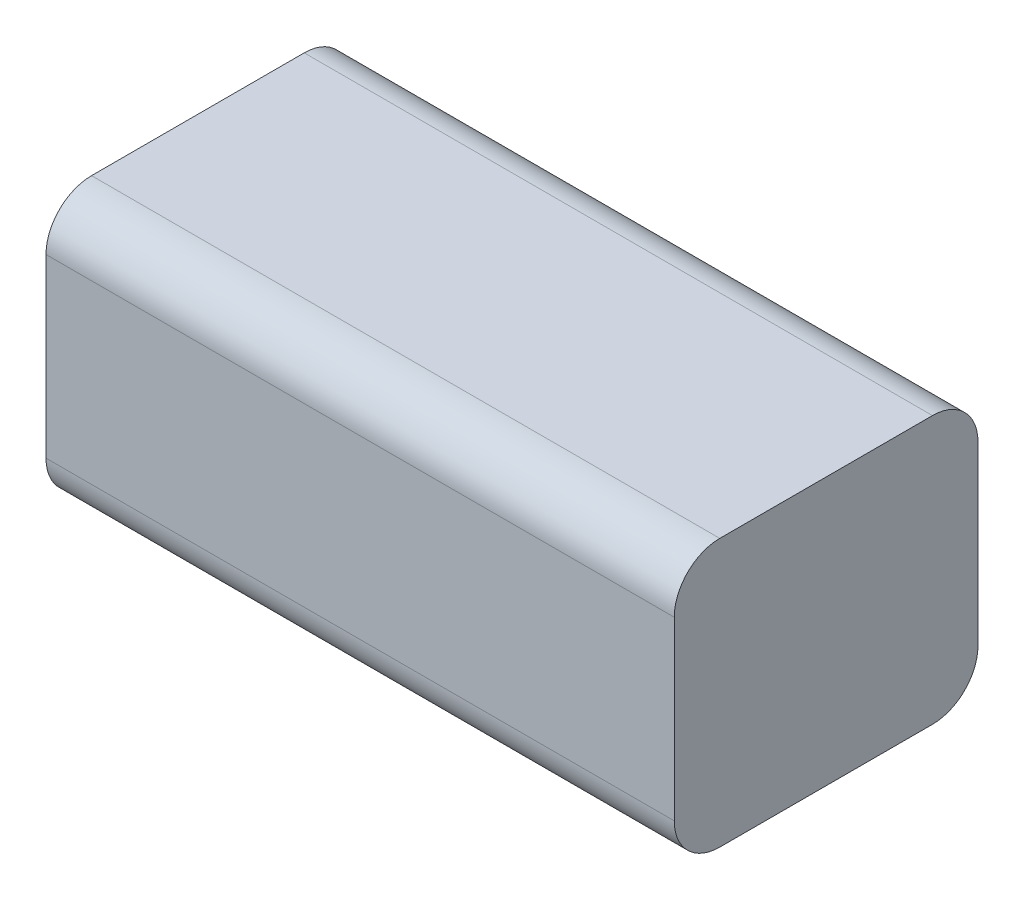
ISO-10303-21;
HEADER;
FILE_DESCRIPTION(('STEP AP214'),'2;1');
FILE_NAME('part.step','',(''),(''),'','','');
FILE_SCHEMA(('AUTOMOTIVE_DESIGN { 1 0 10303 214 1 1 1 1 }'));
ENDSEC;
DATA;
#1=APPLICATION_CONTEXT('core data for automotive mechanical design processes');
#2=APPLICATION_PROTOCOL_DEFINITION('international standard','automotive_design',2000,#1);
#3=PRODUCT_CONTEXT('',#1,'mechanical');
#4=PRODUCT('Part','Part','',(#3));
#5=PRODUCT_RELATED_PRODUCT_CATEGORY('part','',(#4));
#6=PRODUCT_DEFINITION_FORMATION('','',#4);
#7=PRODUCT_DEFINITION_CONTEXT('part definition',#1,'design');
#8=PRODUCT_DEFINITION('design','',#6,#7);
#9=PRODUCT_DEFINITION_SHAPE('','',#8);
#10=(LENGTH_UNIT() NAMED_UNIT(*) SI_UNIT(.MILLI.,.METRE.));
#11=(NAMED_UNIT(*) PLANE_ANGLE_UNIT() SI_UNIT($,.RADIAN.));
#12=(NAMED_UNIT(*) SI_UNIT($,.STERADIAN.) SOLID_ANGLE_UNIT());
#13=UNCERTAINTY_MEASURE_WITH_UNIT(LENGTH_MEASURE(1.E-05),#10,'distance_accuracy_value','');
#14=(GEOMETRIC_REPRESENTATION_CONTEXT(3) GLOBAL_UNCERTAINTY_ASSIGNED_CONTEXT((#13)) GLOBAL_UNIT_ASSIGNED_CONTEXT((#10,
#11,#12)) REPRESENTATION_CONTEXT('',''));
#15=CARTESIAN_POINT('',(0.,0.,0.));
#16=DIRECTION('',(0.,0.,1.));
#17=DIRECTION('',(1.,0.,0.));
#18=AXIS2_PLACEMENT_3D('',#15,#16,#17);
#19=CARTESIAN_POINT('',(58.65,-10.2795,-11.676));
#20=DIRECTION('',(0.,0.,1.));
#21=DIRECTION('',(1.,0.,0.));
#22=AXIS2_PLACEMENT_3D('',#19,#20,#21);
#23=PLANE('',#22);
#24=DIRECTION('',(0.,1.,0.));
#25=VECTOR('',#24,1.);
#26=CARTESIAN_POINT('',(58.65,-10.2795,-11.676));
#27=LINE('',#26,#25);
#28=CARTESIAN_POINT('',(58.65,-6.7795,-11.676));
#29=VERTEX_POINT('',#28);
#30=CARTESIAN_POINT('',(58.65,6.7795,-11.676));
#31=VERTEX_POINT('',#30);
#32=EDGE_CURVE('E143',#29,#31,#27,.T.);
#33=ORIENTED_EDGE('',*,*,#32,.F.);
#34=DIRECTION('',(-1.,0.,0.));
#35=VECTOR('',#34,1.);
#36=CARTESIAN_POINT('',(58.65,-6.7795,-11.676));
#37=LINE('',#36,#35);
#38=CARTESIAN_POINT('',(10.35,-6.7795,-11.676));
#39=VERTEX_POINT('',#38);
#40=EDGE_CURVE('E182',#29,#39,#37,.T.);
#41=ORIENTED_EDGE('',*,*,#40,.T.);
#42=DIRECTION('',(0.,1.,0.));
#43=VECTOR('',#42,1.);
#44=CARTESIAN_POINT('',(10.35,-10.2795,-11.676));
#45=LINE('',#44,#43);
#46=CARTESIAN_POINT('',(10.35,6.7795,-11.676));
#47=VERTEX_POINT('',#46);
#48=EDGE_CURVE('E193',#39,#47,#45,.T.);
#49=ORIENTED_EDGE('',*,*,#48,.T.);
#50=DIRECTION('',(-1.,0.,0.));
#51=VECTOR('',#50,1.);
#52=CARTESIAN_POINT('',(58.65,6.7795,-11.676));
#53=LINE('',#52,#51);
#54=EDGE_CURVE('E179',#47,#31,#53,.F.);
#55=ORIENTED_EDGE('',*,*,#54,.T.);
#56=EDGE_LOOP('',(#33,#41,#49,#55));
#57=FACE_BOUND('',#56,.T.);
#58=ADVANCED_FACE('F48',(#57),#23,.F.);
#59=CARTESIAN_POINT('',(58.65,10.2795,11.676));
#60=DIRECTION('',(0.,-1.,0.));
#61=DIRECTION('',(0.,0.,-1.));
#62=AXIS2_PLACEMENT_3D('',#59,#60,#61);
#63=PLANE('',#62);
#64=DIRECTION('',(0.,0.,1.));
#65=VECTOR('',#64,1.);
#66=CARTESIAN_POINT('',(10.35,10.2795,11.676));
#67=LINE('',#66,#65);
#68=CARTESIAN_POINT('',(10.35,10.2795,-8.176));
#69=VERTEX_POINT('',#68);
#70=CARTESIAN_POINT('',(10.35,10.2795,8.176));
#71=VERTEX_POINT('',#70);
#72=EDGE_CURVE('E150',#69,#71,#67,.T.);
#73=ORIENTED_EDGE('',*,*,#72,.T.);
#74=DIRECTION('',(-1.,0.,0.));
#75=VECTOR('',#74,1.);
#76=CARTESIAN_POINT('',(58.65,10.2795,8.176));
#77=LINE('',#76,#75);
#78=CARTESIAN_POINT('',(58.65,10.2795,8.176));
#79=VERTEX_POINT('',#78);
#80=EDGE_CURVE('E12',#71,#79,#77,.F.);
#81=ORIENTED_EDGE('',*,*,#80,.T.);
#82=DIRECTION('',(0.,0.,1.));
#83=VECTOR('',#82,1.);
#84=CARTESIAN_POINT('',(58.65,10.2795,11.676));
#85=LINE('',#84,#83);
#86=CARTESIAN_POINT('',(58.65,10.2795,-8.176));
#87=VERTEX_POINT('',#86);
#88=EDGE_CURVE('E148',#87,#79,#85,.T.);
#89=ORIENTED_EDGE('',*,*,#88,.F.);
#90=DIRECTION('',(-1.,0.,0.));
#91=VECTOR('',#90,1.);
#92=CARTESIAN_POINT('',(58.65,10.2795,-8.176));
#93=LINE('',#92,#91);
#94=EDGE_CURVE('E57',#87,#69,#93,.T.);
#95=ORIENTED_EDGE('',*,*,#94,.T.);
#96=EDGE_LOOP('',(#73,#81,#89,#95));
#97=FACE_BOUND('',#96,.T.);
#98=ADVANCED_FACE('F189',(#97),#63,.F.);
#99=CARTESIAN_POINT('',(58.65,-10.2795,11.676));
#100=DIRECTION('',(0.,0.,-1.));
#101=DIRECTION('',(-1.,0.,0.));
#102=AXIS2_PLACEMENT_3D('',#99,#100,#101);
#103=PLANE('',#102);
#104=DIRECTION('',(0.,-1.,0.));
#105=VECTOR('',#104,1.);
#106=CARTESIAN_POINT('',(10.35,-10.2795,11.676));
#107=LINE('',#106,#105);
#108=CARTESIAN_POINT('',(10.35,6.7795,11.676));
#109=VERTEX_POINT('',#108);
#110=CARTESIAN_POINT('',(10.35,-6.7795,11.676));
#111=VERTEX_POINT('',#110);
#112=EDGE_CURVE('E144',#109,#111,#107,.T.);
#113=ORIENTED_EDGE('',*,*,#112,.T.);
#114=DIRECTION('',(-1.,0.,0.));
#115=VECTOR('',#114,1.);
#116=CARTESIAN_POINT('',(58.65,-6.7795,11.676));
#117=LINE('',#116,#115);
#118=CARTESIAN_POINT('',(58.65,-6.7795,11.676));
#119=VERTEX_POINT('',#118);
#120=EDGE_CURVE('E119',#111,#119,#117,.F.);
#121=ORIENTED_EDGE('',*,*,#120,.T.);
#122=DIRECTION('',(0.,-1.,0.));
#123=VECTOR('',#122,1.);
#124=CARTESIAN_POINT('',(58.65,-10.2795,11.676));
#125=LINE('',#124,#123);
#126=CARTESIAN_POINT('',(58.65,6.7795,11.676));
#127=VERTEX_POINT('',#126);
#128=EDGE_CURVE('E199',#127,#119,#125,.T.);
#129=ORIENTED_EDGE('',*,*,#128,.F.);
#130=DIRECTION('',(-1.,0.,0.));
#131=VECTOR('',#130,1.);
#132=CARTESIAN_POINT('',(58.65,6.7795,11.676));
#133=LINE('',#132,#131);
#134=EDGE_CURVE('E125',#127,#109,#133,.T.);
#135=ORIENTED_EDGE('',*,*,#134,.T.);
#136=EDGE_LOOP('',(#113,#121,#129,#135));
#137=FACE_BOUND('',#136,.T.);
#138=ADVANCED_FACE('F211',(#137),#103,.F.);
#139=CARTESIAN_POINT('',(58.65,-10.2795,11.676));
#140=DIRECTION('',(0.,1.,0.));
#141=DIRECTION('',(0.,0.,1.));
#142=AXIS2_PLACEMENT_3D('',#139,#140,#141);
#143=PLANE('',#142);
#144=DIRECTION('',(0.,0.,-1.));
#145=VECTOR('',#144,1.);
#146=CARTESIAN_POINT('',(58.65,-10.2795,11.676));
#147=LINE('',#146,#145);
#148=CARTESIAN_POINT('',(58.65,-10.2795,8.176));
#149=VERTEX_POINT('',#148);
#150=CARTESIAN_POINT('',(58.65,-10.2795,-8.176));
#151=VERTEX_POINT('',#150);
#152=EDGE_CURVE('E135',#149,#151,#147,.T.);
#153=ORIENTED_EDGE('',*,*,#152,.F.);
#154=DIRECTION('',(-1.,0.,0.));
#155=VECTOR('',#154,1.);
#156=CARTESIAN_POINT('',(58.65,-10.2795,8.176));
#157=LINE('',#156,#155);
#158=CARTESIAN_POINT('',(10.35,-10.2795,8.176));
#159=VERTEX_POINT('',#158);
#160=EDGE_CURVE('E118',#149,#159,#157,.T.);
#161=ORIENTED_EDGE('',*,*,#160,.T.);
#162=DIRECTION('',(0.,0.,-1.));
#163=VECTOR('',#162,1.);
#164=CARTESIAN_POINT('',(10.35,-10.2795,11.676));
#165=LINE('',#164,#163);
#166=CARTESIAN_POINT('',(10.35,-10.2795,-8.176));
#167=VERTEX_POINT('',#166);
#168=EDGE_CURVE('E132',#159,#167,#165,.T.);
#169=ORIENTED_EDGE('',*,*,#168,.T.);
#170=DIRECTION('',(-1.,0.,0.));
#171=VECTOR('',#170,1.);
#172=CARTESIAN_POINT('',(58.65,-10.2795,-8.176));
#173=LINE('',#172,#171);
#174=EDGE_CURVE('E138',#167,#151,#173,.F.);
#175=ORIENTED_EDGE('',*,*,#174,.T.);
#176=EDGE_LOOP('',(#153,#161,#169,#175));
#177=FACE_BOUND('',#176,.T.);
#178=ADVANCED_FACE('F131',(#177),#143,.F.);
#179=CARTESIAN_POINT('',(58.65,0.,0.));
#180=DIRECTION('',(-1.,0.,0.));
#181=DIRECTION('',(0.,0.,1.));
#182=AXIS2_PLACEMENT_3D('',#179,#180,#181);
#183=PLANE('',#182);
#184=ORIENTED_EDGE('',*,*,#128,.T.);
#185=CARTESIAN_POINT('',(58.65,-6.7795,8.176));
#186=DIRECTION('',(-1.,0.,0.));
#187=DIRECTION('',(0.,0.,1.));
#188=AXIS2_PLACEMENT_3D('',#185,#186,#187);
#189=CIRCLE('',#188,3.5);
#190=EDGE_CURVE('E176',#119,#149,#189,.F.);
#191=ORIENTED_EDGE('',*,*,#190,.T.);
#192=ORIENTED_EDGE('',*,*,#152,.T.);
#193=CARTESIAN_POINT('',(58.65,-6.7795,-8.176));
#194=DIRECTION('',(-1.,0.,0.));
#195=DIRECTION('',(0.,0.,1.));
#196=AXIS2_PLACEMENT_3D('',#193,#194,#195);
#197=CIRCLE('',#196,3.5);
#198=EDGE_CURVE('E173',#151,#29,#197,.F.);
#199=ORIENTED_EDGE('',*,*,#198,.T.);
#200=ORIENTED_EDGE('',*,*,#32,.T.);
#201=CARTESIAN_POINT('',(58.65,6.7795,-8.176));
#202=DIRECTION('',(-1.,0.,0.));
#203=DIRECTION('',(0.,0.,1.));
#204=AXIS2_PLACEMENT_3D('',#201,#202,#203);
#205=CIRCLE('',#204,3.5);
#206=EDGE_CURVE('E69',#31,#87,#205,.F.);
#207=ORIENTED_EDGE('',*,*,#206,.T.);
#208=ORIENTED_EDGE('',*,*,#88,.T.);
#209=CARTESIAN_POINT('',(58.65,6.7795,8.176));
#210=DIRECTION('',(-1.,0.,0.));
#211=DIRECTION('',(0.,0.,1.));
#212=AXIS2_PLACEMENT_3D('',#209,#210,#211);
#213=CIRCLE('',#212,3.5);
#214=EDGE_CURVE('E170',#79,#127,#213,.F.);
#215=ORIENTED_EDGE('',*,*,#214,.T.);
#216=EDGE_LOOP('',(#184,#191,#192,#199,#200,#207,#208,#215));
#217=FACE_BOUND('',#216,.T.);
#218=ADVANCED_FACE('F205',(#217),#183,.F.);
#219=CARTESIAN_POINT('',(10.35,0.,0.));
#220=DIRECTION('',(-1.,0.,0.));
#221=DIRECTION('',(0.,0.,1.));
#222=AXIS2_PLACEMENT_3D('',#219,#220,#221);
#223=PLANE('',#222);
#224=ORIENTED_EDGE('',*,*,#168,.F.);
#225=CARTESIAN_POINT('',(10.35,-6.7795,8.176));
#226=DIRECTION('',(-1.,0.,0.));
#227=DIRECTION('',(0.,0.,1.));
#228=AXIS2_PLACEMENT_3D('',#225,#226,#227);
#229=CIRCLE('',#228,3.5);
#230=EDGE_CURVE('E114',#159,#111,#229,.T.);
#231=ORIENTED_EDGE('',*,*,#230,.T.);
#232=ORIENTED_EDGE('',*,*,#112,.F.);
#233=CARTESIAN_POINT('',(10.35,6.7795,8.176));
#234=DIRECTION('',(-1.,0.,0.));
#235=DIRECTION('',(0.,0.,1.));
#236=AXIS2_PLACEMENT_3D('',#233,#234,#235);
#237=CIRCLE('',#236,3.5);
#238=EDGE_CURVE('E158',#109,#71,#237,.T.);
#239=ORIENTED_EDGE('',*,*,#238,.T.);
#240=ORIENTED_EDGE('',*,*,#72,.F.);
#241=CARTESIAN_POINT('',(10.35,6.7795,-8.176));
#242=DIRECTION('',(-1.,0.,0.));
#243=DIRECTION('',(0.,0.,1.));
#244=AXIS2_PLACEMENT_3D('',#241,#242,#243);
#245=CIRCLE('',#244,3.5);
#246=EDGE_CURVE('E137',#69,#47,#245,.T.);
#247=ORIENTED_EDGE('',*,*,#246,.T.);
#248=ORIENTED_EDGE('',*,*,#48,.F.);
#249=CARTESIAN_POINT('',(10.35,-6.7795,-8.176));
#250=DIRECTION('',(-1.,0.,0.));
#251=DIRECTION('',(0.,0.,1.));
#252=AXIS2_PLACEMENT_3D('',#249,#250,#251);
#253=CIRCLE('',#252,3.5);
#254=EDGE_CURVE('E126',#39,#167,#253,.T.);
#255=ORIENTED_EDGE('',*,*,#254,.T.);
#256=EDGE_LOOP('',(#224,#231,#232,#239,#240,#247,#248,#255));
#257=FACE_BOUND('',#256,.T.);
#258=ADVANCED_FACE('F140',(#257),#223,.T.);
#259=CARTESIAN_POINT('',(58.65,-6.7795,8.176));
#260=DIRECTION('',(-1.,0.,0.));
#261=DIRECTION('',(0.,0.,1.));
#262=AXIS2_PLACEMENT_3D('',#259,#260,#261);
#263=CYLINDRICAL_SURFACE('',#262,3.5);
#264=ORIENTED_EDGE('',*,*,#190,.F.);
#265=ORIENTED_EDGE('',*,*,#120,.F.);
#266=ORIENTED_EDGE('',*,*,#230,.F.);
#267=ORIENTED_EDGE('',*,*,#160,.F.);
#268=EDGE_LOOP('',(#264,#265,#266,#267));
#269=FACE_BOUND('',#268,.T.);
#270=ADVANCED_FACE('F117',(#269),#263,.T.);
#271=CARTESIAN_POINT('',(58.65,-6.7795,-8.176));
#272=DIRECTION('',(-1.,0.,0.));
#273=DIRECTION('',(0.,0.,1.));
#274=AXIS2_PLACEMENT_3D('',#271,#272,#273);
#275=CYLINDRICAL_SURFACE('',#274,3.5);
#276=ORIENTED_EDGE('',*,*,#198,.F.);
#277=ORIENTED_EDGE('',*,*,#174,.F.);
#278=ORIENTED_EDGE('',*,*,#254,.F.);
#279=ORIENTED_EDGE('',*,*,#40,.F.);
#280=EDGE_LOOP('',(#276,#277,#278,#279));
#281=FACE_BOUND('',#280,.T.);
#282=ADVANCED_FACE('F216',(#281),#275,.T.);
#283=CARTESIAN_POINT('',(58.65,6.7795,8.176));
#284=DIRECTION('',(-1.,0.,0.));
#285=DIRECTION('',(0.,0.,1.));
#286=AXIS2_PLACEMENT_3D('',#283,#284,#285);
#287=CYLINDRICAL_SURFACE('',#286,3.5);
#288=ORIENTED_EDGE('',*,*,#214,.F.);
#289=ORIENTED_EDGE('',*,*,#80,.F.);
#290=ORIENTED_EDGE('',*,*,#238,.F.);
#291=ORIENTED_EDGE('',*,*,#134,.F.);
#292=EDGE_LOOP('',(#288,#289,#290,#291));
#293=FACE_BOUND('',#292,.T.);
#294=ADVANCED_FACE('F209',(#293),#287,.T.);
#295=CARTESIAN_POINT('',(58.65,6.7795,-8.176));
#296=DIRECTION('',(-1.,0.,0.));
#297=DIRECTION('',(0.,0.,1.));
#298=AXIS2_PLACEMENT_3D('',#295,#296,#297);
#299=CYLINDRICAL_SURFACE('',#298,3.5);
#300=ORIENTED_EDGE('',*,*,#206,.F.);
#301=ORIENTED_EDGE('',*,*,#54,.F.);
#302=ORIENTED_EDGE('',*,*,#246,.F.);
#303=ORIENTED_EDGE('',*,*,#94,.F.);
#304=EDGE_LOOP('',(#300,#301,#302,#303));
#305=FACE_BOUND('',#304,.T.);
#306=ADVANCED_FACE('F50',(#305),#299,.T.);
#307=CLOSED_SHELL('',(#58,#98,#138,#178,#218,#258,#270,#282,#294,#306));
#308=MANIFOLD_SOLID_BREP('B2',#307);
#309=ADVANCED_BREP_SHAPE_REPRESENTATION('',(#18,#308),#14);
#310=SHAPE_DEFINITION_REPRESENTATION(#9,#309);
ENDSEC;
END-ISO-10303-21;
